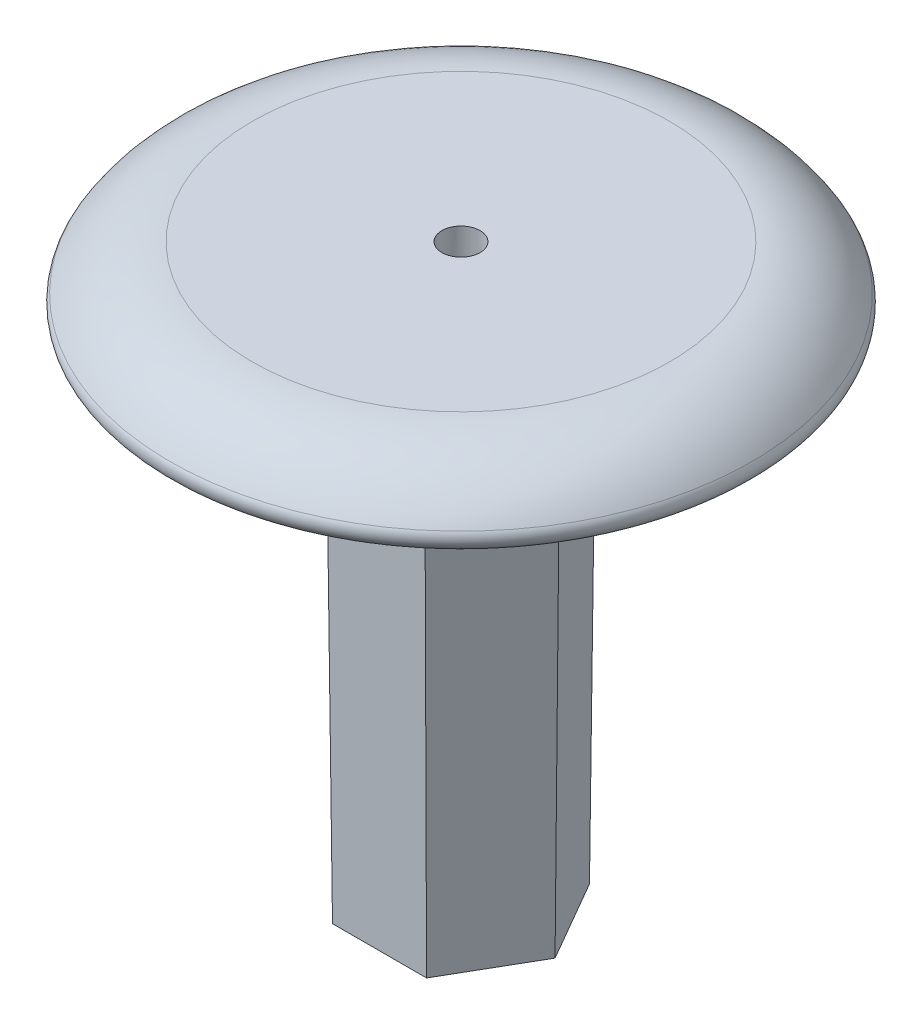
ISO-10303-21;
HEADER;
FILE_DESCRIPTION(('STEP AP214'),'2;1');
FILE_NAME('part.step','',(''),(''),'','','');
FILE_SCHEMA(('AUTOMOTIVE_DESIGN { 1 0 10303 214 1 1 1 1 }'));
ENDSEC;
DATA;
#1=APPLICATION_CONTEXT('core data for automotive mechanical design processes');
#2=APPLICATION_PROTOCOL_DEFINITION('international standard','automotive_design',2000,#1);
#3=PRODUCT_CONTEXT('',#1,'mechanical');
#4=PRODUCT('Part','Part','',(#3));
#5=PRODUCT_RELATED_PRODUCT_CATEGORY('part','',(#4));
#6=PRODUCT_DEFINITION_FORMATION('','',#4);
#7=PRODUCT_DEFINITION_CONTEXT('part definition',#1,'design');
#8=PRODUCT_DEFINITION('design','',#6,#7);
#9=PRODUCT_DEFINITION_SHAPE('','',#8);
#10=(LENGTH_UNIT() NAMED_UNIT(*) SI_UNIT(.MILLI.,.METRE.));
#11=(NAMED_UNIT(*) PLANE_ANGLE_UNIT() SI_UNIT($,.RADIAN.));
#12=(NAMED_UNIT(*) SI_UNIT($,.STERADIAN.) SOLID_ANGLE_UNIT());
#13=UNCERTAINTY_MEASURE_WITH_UNIT(LENGTH_MEASURE(1.E-05),#10,'distance_accuracy_value','');
#14=(GEOMETRIC_REPRESENTATION_CONTEXT(3) GLOBAL_UNCERTAINTY_ASSIGNED_CONTEXT((#13)) GLOBAL_UNIT_ASSIGNED_CONTEXT((#10,
#11,#12)) REPRESENTATION_CONTEXT('',''));
#15=CARTESIAN_POINT('',(0.,0.,0.));
#16=DIRECTION('',(0.,0.,1.));
#17=DIRECTION('',(1.,0.,0.));
#18=AXIS2_PLACEMENT_3D('',#15,#16,#17);
#19=CARTESIAN_POINT('',(0.,0.,0.));
#20=DIRECTION('',(0.,1.,0.));
#21=DIRECTION('',(-1.,0.,0.));
#22=AXIS2_PLACEMENT_3D('',#19,#20,#21);
#23=PLANE('',#22);
#24=DIRECTION('',(-1.,0.,0.));
#25=VECTOR('',#24,1.);
#26=CARTESIAN_POINT('',(-1.93290906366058,0.,-4.60686194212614));
#27=LINE('',#26,#25);
#28=CARTESIAN_POINT('',(2.65977298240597,0.,-4.60686194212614));
#29=VERTEX_POINT('',#28);
#30=CARTESIAN_POINT('',(-2.65977298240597,0.,-4.60686194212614));
#31=VERTEX_POINT('',#30);
#32=EDGE_CURVE('E161',#29,#31,#27,.T.);
#33=ORIENTED_EDGE('',*,*,#32,.T.);
#34=DIRECTION('',(-0.5,0.,0.866025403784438));
#35=VECTOR('',#34,1.);
#36=CARTESIAN_POINT('',(-4.95611400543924,0.,-0.629482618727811));
#37=LINE('',#36,#35);
#38=CARTESIAN_POINT('',(-5.31954596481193,0.,0.));
#39=VERTEX_POINT('',#38);
#40=EDGE_CURVE('E163',#31,#39,#37,.T.);
#41=ORIENTED_EDGE('',*,*,#40,.T.);
#42=DIRECTION('',(0.5,0.,0.866025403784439));
#43=VECTOR('',#42,1.);
#44=CARTESIAN_POINT('',(-3.98965947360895,0.,2.30343097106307));
#45=LINE('',#44,#43);
#46=CARTESIAN_POINT('',(-2.65977298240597,0.,4.60686194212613));
#47=VERTEX_POINT('',#46);
#48=EDGE_CURVE('E153',#39,#47,#45,.T.);
#49=ORIENTED_EDGE('',*,*,#48,.T.);
#50=DIRECTION('',(1.,0.,0.));
#51=VECTOR('',#50,1.);
#52=CARTESIAN_POINT('',(0.,0.,4.60686194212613));
#53=LINE('',#52,#51);
#54=CARTESIAN_POINT('',(2.65977298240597,0.,4.60686194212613));
#55=VERTEX_POINT('',#54);
#56=EDGE_CURVE('E155',#47,#55,#53,.T.);
#57=ORIENTED_EDGE('',*,*,#56,.T.);
#58=DIRECTION('',(0.5,0.,-0.866025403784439));
#59=VECTOR('',#58,1.);
#60=CARTESIAN_POINT('',(4.95611400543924,0.,0.629482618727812));
#61=LINE('',#60,#59);
#62=CARTESIAN_POINT('',(5.31954596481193,0.,0.));
#63=VERTEX_POINT('',#62);
#64=EDGE_CURVE('E157',#55,#63,#61,.T.);
#65=ORIENTED_EDGE('',*,*,#64,.T.);
#66=DIRECTION('',(-0.5,0.,-0.866025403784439));
#67=VECTOR('',#66,1.);
#68=CARTESIAN_POINT('',(3.98965947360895,0.,-2.30343097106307));
#69=LINE('',#68,#67);
#70=EDGE_CURVE('E159',#63,#29,#69,.T.);
#71=ORIENTED_EDGE('',*,*,#70,.T.);
#72=EDGE_LOOP('',(#33,#41,#49,#57,#65,#71));
#73=FACE_BOUND('',#72,.T.);
#74=CARTESIAN_POINT('',(0.,0.,0.));
#75=DIRECTION('',(0.,1.,0.));
#76=DIRECTION('',(-1.,0.,0.));
#77=AXIS2_PLACEMENT_3D('',#74,#75,#76);
#78=CIRCLE('',#77,10.9104305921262);
#79=CARTESIAN_POINT('',(-10.9104305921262,0.,0.));
#80=VERTEX_POINT('',#79);
#81=EDGE_CURVE('E136',#80,#80,#78,.T.);
#82=ORIENTED_EDGE('',*,*,#81,.F.);
#83=EDGE_LOOP('',(#82));
#84=FACE_BOUND('',#83,.T.);
#85=ADVANCED_FACE('F28',(#73,#84),#23,.F.);
#86=CARTESIAN_POINT('',(0.,0.507999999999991,0.));
#87=DIRECTION('',(0.,1.,0.));
#88=DIRECTION('',(-1.,0.,0.));
#89=AXIS2_PLACEMENT_3D('',#86,#87,#88);
#90=TOROIDAL_SURFACE('',#89,10.9104305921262,0.508);
#91=CARTESIAN_POINT('',(0.,0.781538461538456,0.));
#92=DIRECTION('',(0.,1.,0.));
#93=DIRECTION('',(-1.,0.,0.));
#94=AXIS2_PLACEMENT_3D('',#91,#92,#93);
#95=CIRCLE('',#94,11.3384968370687);
#96=CARTESIAN_POINT('',(-11.3384968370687,0.781538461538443,0.));
#97=VERTEX_POINT('',#96);
#98=EDGE_CURVE('E133',#97,#97,#95,.T.);
#99=ORIENTED_EDGE('',*,*,#98,.F.);
#100=EDGE_LOOP('',(#99));
#101=FACE_BOUND('',#100,.T.);
#102=ORIENTED_EDGE('',*,*,#81,.T.);
#103=EDGE_LOOP('',(#102));
#104=FACE_BOUND('',#103,.T.);
#105=ADVANCED_FACE('F211',(#101,#104),#90,.T.);
#106=CARTESIAN_POINT('',(0.,-1.27000000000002,0.));
#107=DIRECTION('',(0.,1.,0.));
#108=DIRECTION('',(-1.,0.,0.));
#109=AXIS2_PLACEMENT_3D('',#106,#107,#108);
#110=TOROIDAL_SURFACE('',#109,8.12799999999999,3.81);
#111=CARTESIAN_POINT('',(0.,2.53999999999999,0.));
#112=DIRECTION('',(0.,1.,0.));
#113=DIRECTION('',(-1.,0.,0.));
#114=AXIS2_PLACEMENT_3D('',#111,#112,#113);
#115=CIRCLE('',#114,8.128);
#116=CARTESIAN_POINT('',(-8.128,2.53999999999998,0.));
#117=VERTEX_POINT('',#116);
#118=EDGE_CURVE('E130',#117,#117,#115,.T.);
#119=ORIENTED_EDGE('',*,*,#118,.F.);
#120=EDGE_LOOP('',(#119));
#121=FACE_BOUND('',#120,.T.);
#122=ORIENTED_EDGE('',*,*,#98,.T.);
#123=EDGE_LOOP('',(#122));
#124=FACE_BOUND('',#123,.T.);
#125=ADVANCED_FACE('F218',(#121,#124),#110,.T.);
#126=CARTESIAN_POINT('',(8.12799999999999,2.54,0.));
#127=DIRECTION('',(0.,-1.,0.));
#128=DIRECTION('',(1.,0.,0.));
#129=AXIS2_PLACEMENT_3D('',#126,#127,#128);
#130=PLANE('',#129);
#131=CARTESIAN_POINT('',(0.,2.54000000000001,0.));
#132=DIRECTION('',(0.,-1.,0.));
#133=DIRECTION('',(1.,0.,0.));
#134=AXIS2_PLACEMENT_3D('',#131,#132,#133);
#135=CIRCLE('',#134,0.743450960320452);
#136=CARTESIAN_POINT('',(0.743450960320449,2.54000000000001,0.));
#137=VERTEX_POINT('',#136);
#138=EDGE_CURVE('E117',#137,#137,#135,.T.);
#139=ORIENTED_EDGE('',*,*,#138,.T.);
#140=EDGE_LOOP('',(#139));
#141=FACE_BOUND('',#140,.T.);
#142=ORIENTED_EDGE('',*,*,#118,.T.);
#143=EDGE_LOOP('',(#142));
#144=FACE_BOUND('',#143,.T.);
#145=ADVANCED_FACE('F224',(#141,#144),#130,.F.);
#146=CARTESIAN_POINT('',(-1.83308710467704,-19.812,3.175));
#147=DIRECTION('',(0.,-0.00872653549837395,0.999961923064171));
#148=DIRECTION('',(0.,-0.999961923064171,-0.00872653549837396));
#149=AXIS2_PLACEMENT_3D('',#146,#147,#148);
#150=PLANE('',#149);
#151=DIRECTION('',(-0.00503820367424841,-0.999949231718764,-0.0087264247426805));
#152=VECTOR('',#151,1.);
#153=CARTESIAN_POINT('',(1.83299404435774,-19.8304699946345,3.17483881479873));
#154=LINE('',#153,#152);
#155=CARTESIAN_POINT('',(1.83308710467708,-19.812,3.175));
#156=VERTEX_POINT('',#155);
#157=CARTESIAN_POINT('',(1.92656605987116,-1.25891729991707,3.33691029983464));
#158=VERTEX_POINT('',#157);
#159=EDGE_CURVE('E109',#156,#158,#154,.F.);
#160=ORIENTED_EDGE('',*,*,#159,.T.);
#161=DIRECTION('',(1.,0.,0.));
#162=VECTOR('',#161,1.);
#163=CARTESIAN_POINT('',(-1.83308710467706,-1.25891729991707,3.33691029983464));
#164=LINE('',#163,#162);
#165=CARTESIAN_POINT('',(-1.92656605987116,-1.25891729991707,3.33691029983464));
#166=VERTEX_POINT('',#165);
#167=EDGE_CURVE('E36',#158,#166,#164,.F.);
#168=ORIENTED_EDGE('',*,*,#167,.T.);
#169=DIRECTION('',(-0.00503820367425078,0.999949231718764,0.0087264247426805));
#170=VECTOR('',#169,1.);
#171=CARTESIAN_POINT('',(-1.8329940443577,-19.8304699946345,3.17483881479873));
#172=LINE('',#171,#170);
#173=CARTESIAN_POINT('',(-1.83308710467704,-19.812,3.175));
#174=VERTEX_POINT('',#173);
#175=EDGE_CURVE('E116',#174,#166,#172,.T.);
#176=ORIENTED_EDGE('',*,*,#175,.F.);
#177=DIRECTION('',(1.,0.,0.));
#178=VECTOR('',#177,1.);
#179=CARTESIAN_POINT('',(-1.83308710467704,-19.812,3.175));
#180=LINE('',#179,#178);
#181=EDGE_CURVE('E104',#174,#156,#180,.T.);
#182=ORIENTED_EDGE('',*,*,#181,.T.);
#183=EDGE_LOOP('',(#160,#168,#176,#182));
#184=FACE_BOUND('',#183,.T.);
#185=ADVANCED_FACE('F115',(#184),#150,.T.);
#186=CARTESIAN_POINT('',(-3.6661742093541,-19.812,0.));
#187=DIRECTION('',(-0.865992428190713,-0.00872653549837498,0.499980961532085));
#188=DIRECTION('',(0.5,0.,0.866025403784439));
#189=AXIS2_PLACEMENT_3D('',#186,#187,#188);
#190=PLANE('',#189);
#191=ORIENTED_EDGE('',*,*,#175,.T.);
#192=DIRECTION('',(0.5,0.,0.866025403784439));
#193=VECTOR('',#192,1.);
#194=CARTESIAN_POINT('',(-3.80639264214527,-1.25891729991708,0.0809551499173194));
#195=LINE('',#194,#193);
#196=CARTESIAN_POINT('',(-3.85313211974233,-1.25891729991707,0.));
#197=VERTEX_POINT('',#196);
#198=EDGE_CURVE('E11',#166,#197,#195,.F.);
#199=ORIENTED_EDGE('',*,*,#198,.T.);
#200=DIRECTION('',(0.0100764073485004,-0.999949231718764,0.));
#201=VECTOR('',#200,1.);
#202=CARTESIAN_POINT('',(-3.6661742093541,-19.812,0.));
#203=LINE('',#202,#201);
#204=CARTESIAN_POINT('',(-3.6661742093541,-19.812,0.));
#205=VERTEX_POINT('',#204);
#206=EDGE_CURVE('E140',#205,#197,#203,.F.);
#207=ORIENTED_EDGE('',*,*,#206,.F.);
#208=DIRECTION('',(0.5,0.,0.866025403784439));
#209=VECTOR('',#208,1.);
#210=CARTESIAN_POINT('',(-3.6661742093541,-19.812,0.));
#211=LINE('',#210,#209);
#212=EDGE_CURVE('E113',#205,#174,#211,.T.);
#213=ORIENTED_EDGE('',*,*,#212,.T.);
#214=EDGE_LOOP('',(#191,#199,#207,#213));
#215=FACE_BOUND('',#214,.T.);
#216=ADVANCED_FACE('F30',(#215),#190,.T.);
#217=CARTESIAN_POINT('',(-3.6661742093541,-19.812,0.));
#218=DIRECTION('',(-0.865992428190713,-0.00872653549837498,-0.499980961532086));
#219=DIRECTION('',(-0.5,0.,0.866025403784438));
#220=AXIS2_PLACEMENT_3D('',#217,#218,#219);
#221=PLANE('',#220);
#222=ORIENTED_EDGE('',*,*,#206,.T.);
#223=DIRECTION('',(0.5,0.,-0.866025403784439));
#224=VECTOR('',#223,1.);
#225=CARTESIAN_POINT('',(-1.92339455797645,-1.25891729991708,-3.34240350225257));
#226=LINE('',#225,#224);
#227=CARTESIAN_POINT('',(-1.92656605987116,-1.25891729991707,-3.33691029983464));
#228=VERTEX_POINT('',#227);
#229=EDGE_CURVE('E139',#197,#228,#226,.T.);
#230=ORIENTED_EDGE('',*,*,#229,.T.);
#231=DIRECTION('',(-0.00503820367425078,0.999949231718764,-0.0087264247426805));
#232=VECTOR('',#231,1.);
#233=CARTESIAN_POINT('',(-1.83308710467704,-19.812,-3.175));
#234=LINE('',#233,#232);
#235=CARTESIAN_POINT('',(-1.83308710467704,-19.812,-3.175));
#236=VERTEX_POINT('',#235);
#237=EDGE_CURVE('E146',#236,#228,#234,.T.);
#238=ORIENTED_EDGE('',*,*,#237,.F.);
#239=DIRECTION('',(0.5,0.,-0.866025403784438));
#240=VECTOR('',#239,1.);
#241=CARTESIAN_POINT('',(-3.6661742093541,-19.812,0.));
#242=LINE('',#241,#240);
#243=EDGE_CURVE('E127',#205,#236,#242,.T.);
#244=ORIENTED_EDGE('',*,*,#243,.F.);
#245=EDGE_LOOP('',(#222,#230,#238,#244));
#246=FACE_BOUND('',#245,.T.);
#247=ADVANCED_FACE('F230',(#246),#221,.T.);
#248=CARTESIAN_POINT('',(-1.83308710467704,-19.812,-3.175));
#249=DIRECTION('',(0.,-0.00872653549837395,-0.999961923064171));
#250=DIRECTION('',(0.,0.999961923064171,-0.00872653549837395));
#251=AXIS2_PLACEMENT_3D('',#248,#249,#250);
#252=PLANE('',#251);
#253=ORIENTED_EDGE('',*,*,#237,.T.);
#254=DIRECTION('',(1.,0.,0.));
#255=VECTOR('',#254,1.);
#256=CARTESIAN_POINT('',(1.93290906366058,-1.25891729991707,-3.33691029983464));
#257=LINE('',#256,#255);
#258=CARTESIAN_POINT('',(1.92656605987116,-1.25891729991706,-3.33691029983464));
#259=VERTEX_POINT('',#258);
#260=EDGE_CURVE('E166',#228,#259,#257,.T.);
#261=ORIENTED_EDGE('',*,*,#260,.T.);
#262=DIRECTION('',(-0.00503820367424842,-0.999949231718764,0.0087264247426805));
#263=VECTOR('',#262,1.);
#264=CARTESIAN_POINT('',(1.83299404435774,-19.8304699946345,-3.17483881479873));
#265=LINE('',#264,#263);
#266=CARTESIAN_POINT('',(1.83308710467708,-19.812,-3.175));
#267=VERTEX_POINT('',#266);
#268=EDGE_CURVE('E143',#267,#259,#265,.F.);
#269=ORIENTED_EDGE('',*,*,#268,.F.);
#270=DIRECTION('',(1.,0.,0.));
#271=VECTOR('',#270,1.);
#272=CARTESIAN_POINT('',(-1.83308710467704,-19.812,-3.175));
#273=LINE('',#272,#271);
#274=EDGE_CURVE('E125',#236,#267,#273,.T.);
#275=ORIENTED_EDGE('',*,*,#274,.F.);
#276=EDGE_LOOP('',(#253,#261,#269,#275));
#277=FACE_BOUND('',#276,.T.);
#278=ADVANCED_FACE('F228',(#277),#252,.T.);
#279=CARTESIAN_POINT('',(3.66617420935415,-19.812,0.));
#280=DIRECTION('',(0.865992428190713,-0.00872653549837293,-0.499980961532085));
#281=DIRECTION('',(-0.5,0.,-0.866025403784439));
#282=AXIS2_PLACEMENT_3D('',#279,#280,#281);
#283=PLANE('',#282);
#284=ORIENTED_EDGE('',*,*,#268,.T.);
#285=DIRECTION('',(-0.5,0.,-0.866025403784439));
#286=VECTOR('',#285,1.);
#287=CARTESIAN_POINT('',(3.80639264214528,-1.25891729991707,-0.0809551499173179));
#288=LINE('',#287,#286);
#289=CARTESIAN_POINT('',(3.85313211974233,-1.25891729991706,0.));
#290=VERTEX_POINT('',#289);
#291=EDGE_CURVE('E168',#259,#290,#288,.F.);
#292=ORIENTED_EDGE('',*,*,#291,.T.);
#293=DIRECTION('',(-0.010076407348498,-0.999949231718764,0.));
#294=VECTOR('',#293,1.);
#295=CARTESIAN_POINT('',(3.66617420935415,-19.812,0.));
#296=LINE('',#295,#294);
#297=CARTESIAN_POINT('',(3.66617420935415,-19.812,0.));
#298=VERTEX_POINT('',#297);
#299=EDGE_CURVE('E112',#298,#290,#296,.F.);
#300=ORIENTED_EDGE('',*,*,#299,.F.);
#301=DIRECTION('',(-0.5,0.,-0.866025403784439));
#302=VECTOR('',#301,1.);
#303=CARTESIAN_POINT('',(3.66617420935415,-19.812,0.));
#304=LINE('',#303,#302);
#305=EDGE_CURVE('E107',#298,#267,#304,.T.);
#306=ORIENTED_EDGE('',*,*,#305,.T.);
#307=EDGE_LOOP('',(#284,#292,#300,#306));
#308=FACE_BOUND('',#307,.T.);
#309=ADVANCED_FACE('F172',(#308),#283,.T.);
#310=CARTESIAN_POINT('',(3.66617420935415,-19.812,0.));
#311=DIRECTION('',(0.865992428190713,-0.00872653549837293,0.499980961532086));
#312=DIRECTION('',(0.5,0.,-0.866025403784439));
#313=AXIS2_PLACEMENT_3D('',#310,#311,#312);
#314=PLANE('',#313);
#315=ORIENTED_EDGE('',*,*,#299,.T.);
#316=DIRECTION('',(-0.5,0.,0.866025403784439));
#317=VECTOR('',#316,1.);
#318=CARTESIAN_POINT('',(1.92339455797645,-1.25891729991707,3.34240350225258));
#319=LINE('',#318,#317);
#320=EDGE_CURVE('E50',#290,#158,#319,.T.);
#321=ORIENTED_EDGE('',*,*,#320,.T.);
#322=ORIENTED_EDGE('',*,*,#159,.F.);
#323=DIRECTION('',(-0.5,0.,0.866025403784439));
#324=VECTOR('',#323,1.);
#325=CARTESIAN_POINT('',(3.66617420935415,-19.812,0.));
#326=LINE('',#325,#324);
#327=EDGE_CURVE('E100',#298,#156,#326,.T.);
#328=ORIENTED_EDGE('',*,*,#327,.F.);
#329=EDGE_LOOP('',(#315,#321,#322,#328));
#330=FACE_BOUND('',#329,.T.);
#331=ADVANCED_FACE('F110',(#330),#314,.T.);
#332=CARTESIAN_POINT('',(5.49926131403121,-19.812,3.175));
#333=DIRECTION('',(0.,1.,0.));
#334=DIRECTION('',(-1.,0.,0.));
#335=AXIS2_PLACEMENT_3D('',#332,#333,#334);
#336=PLANE('',#335);
#337=CARTESIAN_POINT('',(0.,-19.812,0.));
#338=DIRECTION('',(0.,-1.,0.));
#339=DIRECTION('',(1.,0.,0.));
#340=AXIS2_PLACEMENT_3D('',#337,#338,#339);
#341=CIRCLE('',#340,1.524);
#342=CARTESIAN_POINT('',(1.52400000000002,-19.812,0.));
#343=VERTEX_POINT('',#342);
#344=EDGE_CURVE('E120',#343,#343,#341,.T.);
#345=ORIENTED_EDGE('',*,*,#344,.F.);
#346=EDGE_LOOP('',(#345));
#347=FACE_BOUND('',#346,.T.);
#348=ORIENTED_EDGE('',*,*,#181,.F.);
#349=ORIENTED_EDGE('',*,*,#212,.F.);
#350=ORIENTED_EDGE('',*,*,#243,.T.);
#351=ORIENTED_EDGE('',*,*,#274,.T.);
#352=ORIENTED_EDGE('',*,*,#305,.F.);
#353=ORIENTED_EDGE('',*,*,#327,.T.);
#354=EDGE_LOOP('',(#348,#349,#350,#351,#352,#353));
#355=FACE_BOUND('',#354,.T.);
#356=ADVANCED_FACE('F101',(#347,#355),#336,.F.);
#357=CARTESIAN_POINT('',(0.,-19.812,0.));
#358=DIRECTION('',(0.,-1.,0.));
#359=DIRECTION('',(1.,0.,0.));
#360=AXIS2_PLACEMENT_3D('',#357,#358,#359);
#361=CONICAL_SURFACE('',#360,1.524,0.0349065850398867);
#362=ORIENTED_EDGE('',*,*,#138,.F.);
#363=EDGE_LOOP('',(#362));
#364=FACE_BOUND('',#363,.T.);
#365=ORIENTED_EDGE('',*,*,#344,.T.);
#366=EDGE_LOOP('',(#365));
#367=FACE_BOUND('',#366,.T.);
#368=ADVANCED_FACE('F197',(#364,#367),#361,.F.);
#369=CARTESIAN_POINT('',(4.90620302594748,-1.27,0.715930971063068));
#370=DIRECTION('',(-0.5,0.,0.866025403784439));
#371=DIRECTION('',(0.866025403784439,0.,0.5));
#372=AXIS2_PLACEMENT_3D('',#369,#370,#371);
#373=CYLINDRICAL_SURFACE('',#372,1.27);
#374=CARTESIAN_POINT('',(5.31954596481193,-1.27,0.));
#375=DIRECTION('',(0.,0.,1.));
#376=DIRECTION('',(-1.,0.,0.));
#377=AXIS2_PLACEMENT_3D('',#374,#375,#376);
#378=ELLIPSE('',#377,1.46646968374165,1.27);
#379=EDGE_CURVE('E182',#63,#290,#378,.T.);
#380=ORIENTED_EDGE('',*,*,#379,.F.);
#381=ORIENTED_EDGE('',*,*,#64,.F.);
#382=CARTESIAN_POINT('',(2.65977298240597,-1.27,4.60686194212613));
#383=DIRECTION('',(0.866025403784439,0.,-0.5));
#384=DIRECTION('',(0.5,0.,0.866025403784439));
#385=AXIS2_PLACEMENT_3D('',#382,#383,#384);
#386=ELLIPSE('',#385,1.46646968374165,1.27);
#387=EDGE_CURVE('E185',#158,#55,#386,.T.);
#388=ORIENTED_EDGE('',*,*,#387,.F.);
#389=ORIENTED_EDGE('',*,*,#320,.F.);
#390=EDGE_LOOP('',(#380,#381,#388,#389));
#391=FACE_BOUND('',#390,.T.);
#392=ADVANCED_FACE('F180',(#391),#373,.F.);
#393=CARTESIAN_POINT('',(0.,-1.27000000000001,4.60686194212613));
#394=DIRECTION('',(1.,0.,0.));
#395=DIRECTION('',(0.,1.,0.));
#396=AXIS2_PLACEMENT_3D('',#393,#394,#395);
#397=CYLINDRICAL_SURFACE('',#396,1.27);
#398=ORIENTED_EDGE('',*,*,#387,.T.);
#399=ORIENTED_EDGE('',*,*,#56,.F.);
#400=CARTESIAN_POINT('',(-2.65977298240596,-1.27000000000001,4.60686194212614));
#401=DIRECTION('',(0.866025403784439,0.,0.5));
#402=DIRECTION('',(-0.5,0.,0.866025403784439));
#403=AXIS2_PLACEMENT_3D('',#400,#401,#402);
#404=ELLIPSE('',#403,1.46646968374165,1.27);
#405=EDGE_CURVE('E187',#166,#47,#404,.T.);
#406=ORIENTED_EDGE('',*,*,#405,.F.);
#407=ORIENTED_EDGE('',*,*,#167,.F.);
#408=EDGE_LOOP('',(#398,#399,#406,#407));
#409=FACE_BOUND('',#408,.T.);
#410=ADVANCED_FACE('F262',(#409),#397,.F.);
#411=CARTESIAN_POINT('',(3.98965947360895,-1.27,-2.30343097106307));
#412=DIRECTION('',(-0.5,0.,-0.866025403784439));
#413=DIRECTION('',(-0.866025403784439,0.,0.5));
#414=AXIS2_PLACEMENT_3D('',#411,#412,#413);
#415=CYLINDRICAL_SURFACE('',#414,1.27);
#416=ORIENTED_EDGE('',*,*,#379,.T.);
#417=ORIENTED_EDGE('',*,*,#291,.F.);
#418=CARTESIAN_POINT('',(2.65977298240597,-1.27,-4.60686194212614));
#419=DIRECTION('',(-0.866025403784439,0.,-0.5));
#420=DIRECTION('',(0.5,0.,-0.866025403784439));
#421=AXIS2_PLACEMENT_3D('',#418,#419,#420);
#422=ELLIPSE('',#421,1.46646968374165,1.27);
#423=EDGE_CURVE('E191',#29,#259,#422,.F.);
#424=ORIENTED_EDGE('',*,*,#423,.F.);
#425=ORIENTED_EDGE('',*,*,#70,.F.);
#426=EDGE_LOOP('',(#416,#417,#424,#425));
#427=FACE_BOUND('',#426,.T.);
#428=ADVANCED_FACE('F186',(#427),#415,.F.);
#429=CARTESIAN_POINT('',(-3.98965947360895,-1.27000000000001,2.30343097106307));
#430=DIRECTION('',(0.5,0.,0.866025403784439));
#431=DIRECTION('',(0.866025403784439,0.,-0.5));
#432=AXIS2_PLACEMENT_3D('',#429,#430,#431);
#433=CYLINDRICAL_SURFACE('',#432,1.27);
#434=ORIENTED_EDGE('',*,*,#405,.T.);
#435=ORIENTED_EDGE('',*,*,#48,.F.);
#436=CARTESIAN_POINT('',(-5.31954596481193,-1.27000000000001,0.));
#437=DIRECTION('',(0.,0.,1.));
#438=DIRECTION('',(1.,0.,0.));
#439=AXIS2_PLACEMENT_3D('',#436,#437,#438);
#440=ELLIPSE('',#439,1.46646968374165,1.27);
#441=EDGE_CURVE('E245',#197,#39,#440,.T.);
#442=ORIENTED_EDGE('',*,*,#441,.F.);
#443=ORIENTED_EDGE('',*,*,#198,.F.);
#444=EDGE_LOOP('',(#434,#435,#442,#443));
#445=FACE_BOUND('',#444,.T.);
#446=ADVANCED_FACE('F246',(#445),#433,.F.);
#447=CARTESIAN_POINT('',(-1.83308710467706,-1.27000000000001,-4.60686194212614));
#448=DIRECTION('',(1.,0.,0.));
#449=DIRECTION('',(0.,1.,0.));
#450=AXIS2_PLACEMENT_3D('',#447,#448,#449);
#451=CYLINDRICAL_SURFACE('',#450,1.27);
#452=ORIENTED_EDGE('',*,*,#423,.T.);
#453=ORIENTED_EDGE('',*,*,#260,.F.);
#454=CARTESIAN_POINT('',(-2.65977298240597,-1.27000000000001,-4.60686194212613));
#455=DIRECTION('',(0.866025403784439,0.,-0.5));
#456=DIRECTION('',(0.5,0.,0.866025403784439));
#457=AXIS2_PLACEMENT_3D('',#454,#455,#456);
#458=ELLIPSE('',#457,1.46646968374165,1.27);
#459=EDGE_CURVE('E249',#31,#228,#458,.T.);
#460=ORIENTED_EDGE('',*,*,#459,.F.);
#461=ORIENTED_EDGE('',*,*,#32,.F.);
#462=EDGE_LOOP('',(#452,#453,#460,#461));
#463=FACE_BOUND('',#462,.T.);
#464=ADVANCED_FACE('F257',(#463),#451,.F.);
#465=CARTESIAN_POINT('',(-4.90620302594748,-1.27000000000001,-0.715930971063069));
#466=DIRECTION('',(0.5,0.,-0.866025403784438));
#467=DIRECTION('',(-0.866025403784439,0.,-0.5));
#468=AXIS2_PLACEMENT_3D('',#465,#466,#467);
#469=CYLINDRICAL_SURFACE('',#468,1.27);
#470=ORIENTED_EDGE('',*,*,#441,.T.);
#471=ORIENTED_EDGE('',*,*,#40,.F.);
#472=ORIENTED_EDGE('',*,*,#459,.T.);
#473=ORIENTED_EDGE('',*,*,#229,.F.);
#474=EDGE_LOOP('',(#470,#471,#472,#473));
#475=FACE_BOUND('',#474,.T.);
#476=ADVANCED_FACE('F251',(#475),#469,.F.);
#477=CLOSED_SHELL('',(#85,#105,#125,#145,#185,#216,#247,#278,#309,#331,#356,#368,#392,#410,#428,
#446,#464,#476));
#478=MANIFOLD_SOLID_BREP('B2',#477);
#479=ADVANCED_BREP_SHAPE_REPRESENTATION('',(#18,#478),#14);
#480=SHAPE_DEFINITION_REPRESENTATION(#9,#479);
ENDSEC;
END-ISO-10303-21;
